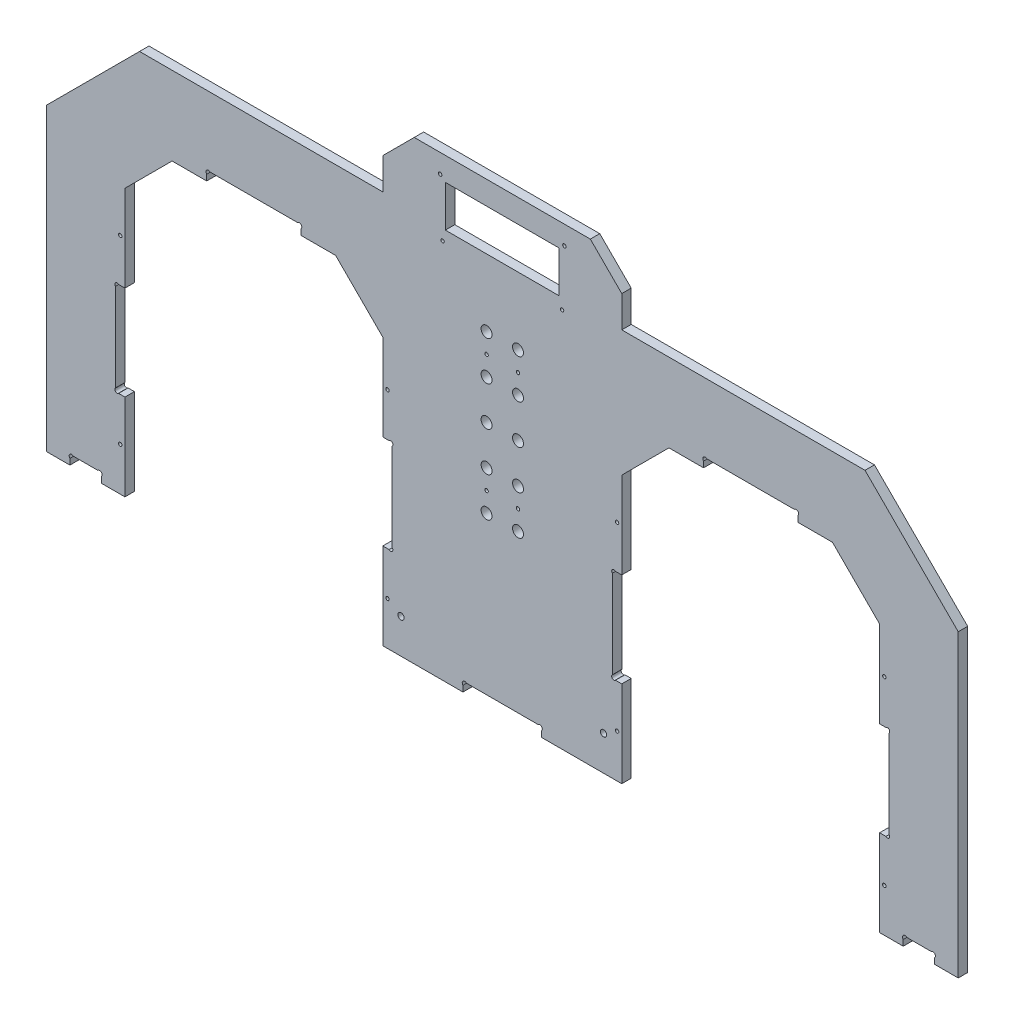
from build123d import *

# Parameters (mm, degrees)
ESQUISSE1_R        = 2
ESQUISSE1_R_2      = 3.475
ESQUISSE1_R_3      = 1.1
ESQUISSE1_W        = 72.4
ESQUISSE1_H        = 26.3
BOSS_EXTRU_1_DEPTH = 6


with BuildPart() as part:
    # Esquisse1 → Boss.-Extru.1 (new body)
    with BuildSketch(Plane.XY):
        with BuildLine():
            Line((240, 170), (240, 115))
            Line((240, 115), (244, 115))
            ThreePointArc((244, 115), (246, 115), (246, 113))
            Line((246, 113), (246, 57))
            ThreePointArc((246, 57), (246, 55), (244, 55))
            Line((244, 55), (240, 55))
            Line((240, 55), (240, 0))
            Line((240, 0), (255, 0))
            Line((255, 0), (255, 3.7372583))
            ThreePointArc((255, 3.7372583), (255, 6), (257.2627417, 6))
            Line((257.2627417, 6), (272.7372583, 6))
            ThreePointArc((272.7372583, 6), (275, 6), (275, 3.7372583))
            Line((275, 3.7372583), (275, 0))
            Line((275, 0), (290, 0))
            Line((290, 0), (290, 190.710678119))
            Line((290, 190.710678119), (230.710678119, 250))
            Line((230.710678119, 250), (76, 250))
            Line((76, 250), (76, 270))
            Line((76, 270), (56, 290))
            Line((56, 290), (-56, 290))
            Line((-56, 290), (-76, 270))
            Line((-76, 270), (-76, 250))
            Line((-76, 250), (-230.710678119, 250))
            Line((-230.710678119, 250), (-290, 190.710678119))
            Line((-290, 190.710678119), (-290, 0))
            Line((-290, 0), (-275, 0))
            Line((-275, 0), (-275, 3.7372583))
            ThreePointArc((-275, 3.7372583), (-275, 6), (-272.7372583, 6))
            Line((-272.7372583, 6), (-257.2627417, 6))
            ThreePointArc((-257.2627417, 6), (-255, 6), (-255, 3.7372583))
            Line((-255, 3.7372583), (-255, 0))
            Line((-255, 0), (-240, 0))
            Line((-240, 0), (-240, 55))
            Line((-240, 55), (-244, 55))
            ThreePointArc((-244, 55), (-246, 55), (-246, 57))
            Line((-246, 57), (-246, 113))
            ThreePointArc((-246, 113), (-246, 115), (-244, 115))
            Line((-244, 115), (-240, 115))
            Line((-240, 115), (-240, 170))
            Line((-240, 170), (-210, 200))
            Line((-210, 200), (-188, 200))
            Line((-188, 200), (-188, 203.7372583))
            ThreePointArc((-188, 203.7372583), (-188, 206), (-185.7372583, 206))
            Line((-185.7372583, 206), (-130.2627417, 206))
            ThreePointArc((-130.2627417, 206), (-128, 206), (-128, 203.7372583))
            Line((-128, 203.7372583), (-128, 200))
            Line((-128, 200), (-106, 200))
            Line((-106, 200), (-76, 170))
            Line((-76, 170), (-76, 115))
            Line((-76, 115), (-72, 115))
            ThreePointArc((-72, 115), (-70, 115), (-70, 113))
            Line((-70, 113), (-70, 57))
            ThreePointArc((-70, 57), (-70, 55), (-72, 55))
            Line((-72, 55), (-76, 55))
            Line((-76, 55), (-76, 0))
            Line((-76, 0), (-25, 0))
            Line((-25, 0), (-25, 3.7372583))
            ThreePointArc((-25, 3.7372583), (-25, 6), (-22.7372583, 6))
            Line((-22.7372583, 6), (22.7372583, 6))
            ThreePointArc((22.7372583, 6), (25, 6), (25, 3.7372583))
            Line((25, 3.7372583), (25, 0))
            Line((25, 0), (76, 0))
            Line((76, 0), (76, 55))
            Line((76, 55), (72, 55))
            ThreePointArc((72, 55), (70, 55), (70, 57))
            Line((70, 57), (70, 113))
            ThreePointArc((70, 113), (70, 115), (72, 115))
            Line((72, 115), (76, 115))
            Line((76, 115), (76, 170))
            Line((76, 170), (106, 200))
            Line((106, 200), (128, 200))
            Line((128, 200), (128, 203.7372583))
            ThreePointArc((128, 203.7372583), (128, 206), (130.2627417, 206))
            Line((130.2627417, 206), (185.7372583, 206))
            ThreePointArc((185.7372583, 206), (188, 206), (188, 203.7372583))
            Line((188, 203.7372583), (188, 200))
            Line((188, 200), (210, 200))
            Line((210, 200), (240, 170))
        make_face()
        with Locations((64.4, 22)):
            Circle(ESQUISSE1_R, mode=Mode.SUBTRACT)
        with Locations((10, 106)):
            Circle(ESQUISSE1_R_2, mode=Mode.SUBTRACT)
        with Locations(Location((-64.4, 22, 0), (0, 0, 180))):
            Circle(ESQUISSE1_R, mode=Mode.SUBTRACT)
        with Locations((243, 142.5)):
            Circle(ESQUISSE1_R_3, mode=Mode.SUBTRACT)
        with Locations((-10, 106)):
            Circle(ESQUISSE1_R_2, mode=Mode.SUBTRACT)
        with Locations((10, 131)):
            Circle(ESQUISSE1_R_2, mode=Mode.SUBTRACT)
        with Locations((-10, 131)):
            Circle(ESQUISSE1_R_2, mode=Mode.SUBTRACT)
        with Locations(Location((243, 27.5, 0), (0, 0, 180))):
            Circle(ESQUISSE1_R_3, mode=Mode.SUBTRACT)
        with Locations((10, 156)):
            Circle(ESQUISSE1_R_2, mode=Mode.SUBTRACT)
        with Locations((-10, 156)):
            Circle(ESQUISSE1_R_2, mode=Mode.SUBTRACT)
        with Locations((10, 181)):
            Circle(ESQUISSE1_R_2, mode=Mode.SUBTRACT)
        with Locations((-10, 181)):
            Circle(ESQUISSE1_R_2, mode=Mode.SUBTRACT)
        with Locations((10, 206)):
            Circle(ESQUISSE1_R_2, mode=Mode.SUBTRACT)
        with Locations((-10, 206)):
            Circle(ESQUISSE1_R_2, mode=Mode.SUBTRACT)
        with Locations((73, 27.5)):
            Circle(ESQUISSE1_R_3, mode=Mode.SUBTRACT)
        with Locations(Location((73, 142.5, 0), (0, 0, 180))):
            Circle(ESQUISSE1_R_3, mode=Mode.SUBTRACT)
        with Locations(Location((-243, 142.5, 0), (0, 0, 180))):
            Circle(ESQUISSE1_R_3, mode=Mode.SUBTRACT)
        with Locations((-243, 27.5)):
            Circle(ESQUISSE1_R_3, mode=Mode.SUBTRACT)
        with Locations(Location((-73, 27.5, 0), (0, 0, 180))):
            Circle(ESQUISSE1_R_3, mode=Mode.SUBTRACT)
        with Locations((-73, 142.5)):
            Circle(ESQUISSE1_R_3, mode=Mode.SUBTRACT)
        with Locations((10, 193.5)):
            Circle(ESQUISSE1_R_3, mode=Mode.SUBTRACT)
        with Locations((10, 118.5)):
            Circle(ESQUISSE1_R_3, mode=Mode.SUBTRACT)
        with Locations(Location((-10, 193.5, 0), (0, 0, 180))):
            Circle(ESQUISSE1_R_3, mode=Mode.SUBTRACT)
        with Locations(Location((-10, 118.5, 0), (0, 0, 180))):
            Circle(ESQUISSE1_R_3, mode=Mode.SUBTRACT)
        with Locations((-39.5, 278)):
            Circle(ESQUISSE1_R_3, mode=Mode.SUBTRACT)
        with Locations((-38, 242)):
            Circle(ESQUISSE1_R_3, mode=Mode.SUBTRACT)
        with Locations(Location((38, 242, 0), (0, 0, 180))):
            Circle(ESQUISSE1_R_3, mode=Mode.SUBTRACT)
        with Locations(Location((39.5, 278, 0), (0, 0, 180))):
            Circle(ESQUISSE1_R_3, mode=Mode.SUBTRACT)
        with Locations((0, 262)):
            Rectangle(ESQUISSE1_W, ESQUISSE1_H, mode=Mode.SUBTRACT)
    extrude(amount=BOSS_EXTRU_1_DEPTH)


solid = part.part
